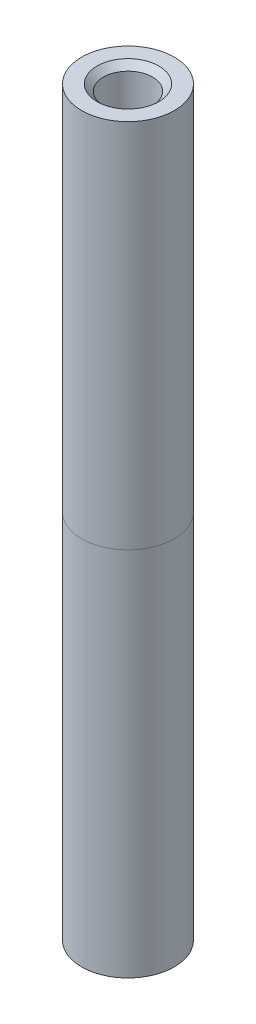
from build123d import *


with BuildPart() as part:
    # Sketch2 → Base-Revolve (revolve)
    with BuildSketch(Plane.XY, mode=Mode.PRIVATE) as base_revolve_sk:
        Polygon((4.7625, -53.178688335), (4.7625, 53.178688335), (5.0419, 53.34), (5.0419, 74.8919), (6.35, 76.2), (9.525, 76.2), (9.525, -76.2), (6.35, -76.2), (5.0419, -74.8919), (5.0419, -53.34), align=None)
    revolve(base_revolve_sk.sketch.rotate(Axis((0, 96.266, 0), (0, -1, 0)), 90), axis=Axis((0, 96.266, 0), (0, -1, 0)))


solid = part.part
